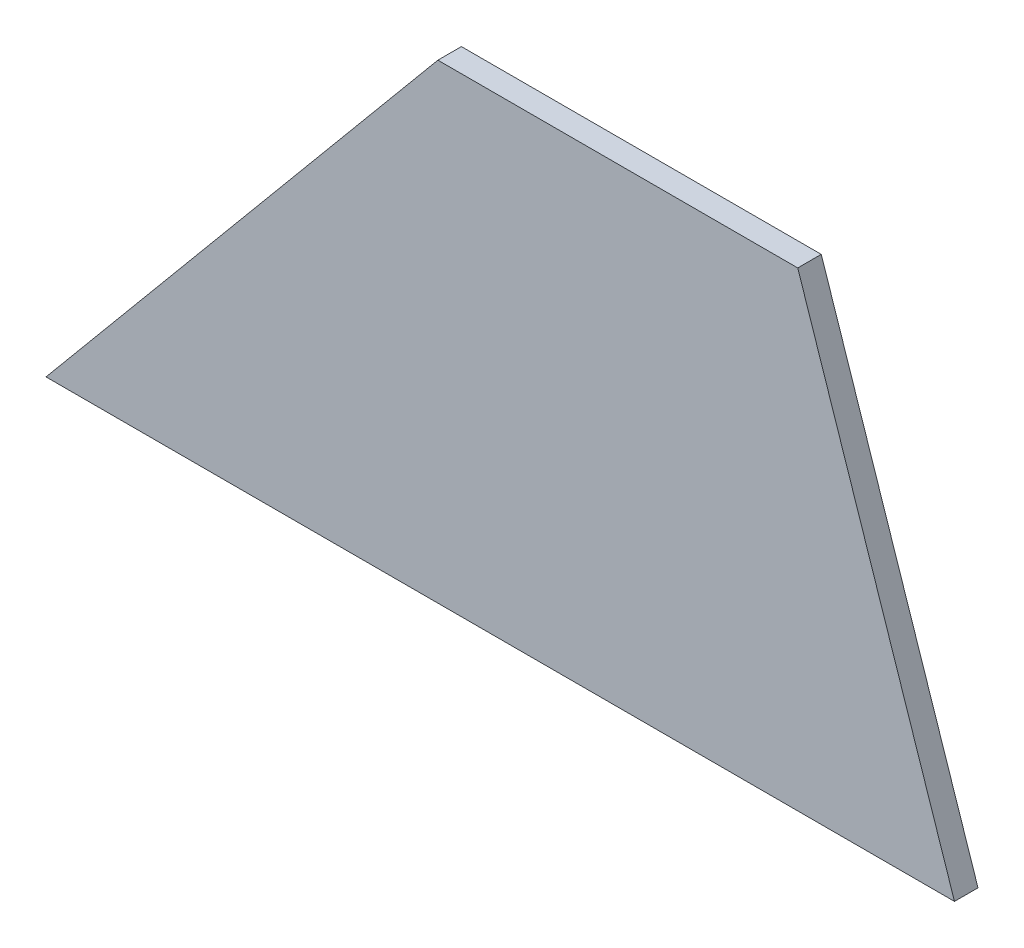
from build123d import *

# Parameters (mm, degrees)
EXTRUDE1_DEPTH = 3.81


with BuildPart() as part:
    # Sketch4 → Extrude1 (new body)
    with BuildSketch(Plane.XY):
        Polygon((63.753651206, 187.354032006), (122.064188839, 187.354032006), (147.464188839, 111.154032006), (0.253651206, 111.154032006), align=None)
    extrude(amount=EXTRUDE1_DEPTH)


solid = part.part
